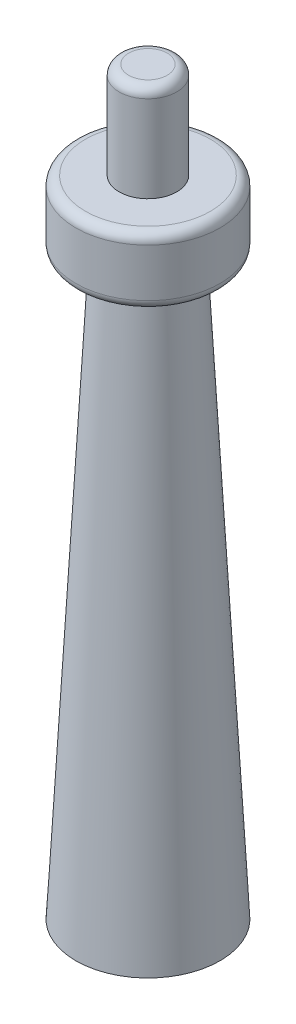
ISO-10303-21;
HEADER;
FILE_DESCRIPTION(('STEP AP214'),'2;1');
FILE_NAME('part.step','',(''),(''),'','','');
FILE_SCHEMA(('AUTOMOTIVE_DESIGN { 1 0 10303 214 1 1 1 1 }'));
ENDSEC;
DATA;
#1=APPLICATION_CONTEXT('core data for automotive mechanical design processes');
#2=APPLICATION_PROTOCOL_DEFINITION('international standard','automotive_design',2000,#1);
#3=PRODUCT_CONTEXT('',#1,'mechanical');
#4=PRODUCT('Part','Part','',(#3));
#5=PRODUCT_RELATED_PRODUCT_CATEGORY('part','',(#4));
#6=PRODUCT_DEFINITION_FORMATION('','',#4);
#7=PRODUCT_DEFINITION_CONTEXT('part definition',#1,'design');
#8=PRODUCT_DEFINITION('design','',#6,#7);
#9=PRODUCT_DEFINITION_SHAPE('','',#8);
#10=(LENGTH_UNIT() NAMED_UNIT(*) SI_UNIT(.MILLI.,.METRE.));
#11=(NAMED_UNIT(*) PLANE_ANGLE_UNIT() SI_UNIT($,.RADIAN.));
#12=(NAMED_UNIT(*) SI_UNIT($,.STERADIAN.) SOLID_ANGLE_UNIT());
#13=UNCERTAINTY_MEASURE_WITH_UNIT(LENGTH_MEASURE(1.E-05),#10,'distance_accuracy_value','');
#14=(GEOMETRIC_REPRESENTATION_CONTEXT(3) GLOBAL_UNCERTAINTY_ASSIGNED_CONTEXT((#13)) GLOBAL_UNIT_ASSIGNED_CONTEXT((#10,
#11,#12)) REPRESENTATION_CONTEXT('',''));
#15=CARTESIAN_POINT('',(0.,0.,0.));
#16=DIRECTION('',(0.,0.,1.));
#17=DIRECTION('',(1.,0.,0.));
#18=AXIS2_PLACEMENT_3D('',#15,#16,#17);
#19=CARTESIAN_POINT('',(0.,0.,0.));
#20=DIRECTION('',(0.,-1.,0.));
#21=DIRECTION('',(0.,0.,1.));
#22=AXIS2_PLACEMENT_3D('',#19,#20,#21);
#23=CONICAL_SURFACE('',#22,750.,0.0523598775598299);
#24=CARTESIAN_POINT('',(0.,5894.76640437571,0.));
#25=DIRECTION('',(0.,-1.,0.));
#26=DIRECTION('',(0.,0.,-1.));
#27=AXIS2_PLACEMENT_3D('',#24,#25,#26);
#28=CIRCLE('',#27,441.068383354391);
#29=CARTESIAN_POINT('',(0.,5894.76640437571,-441.068383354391));
#30=VERTEX_POINT('',#29);
#31=EDGE_CURVE('E58',#30,#30,#28,.T.);
#32=ORIENTED_EDGE('',*,*,#31,.T.);
#33=EDGE_LOOP('',(#32));
#34=FACE_BOUND('',#33,.T.);
#35=CARTESIAN_POINT('',(0.,0.,0.));
#36=DIRECTION('',(0.,1.,0.));
#37=DIRECTION('',(0.,0.,1.));
#38=AXIS2_PLACEMENT_3D('',#35,#36,#37);
#39=CIRCLE('',#38,750.);
#40=CARTESIAN_POINT('',(0.,0.,750.));
#41=VERTEX_POINT('',#40);
#42=EDGE_CURVE('E64',#41,#41,#39,.T.);
#43=ORIENTED_EDGE('',*,*,#42,.T.);
#44=EDGE_LOOP('',(#43));
#45=FACE_BOUND('',#44,.T.);
#46=ADVANCED_FACE('F32',(#34,#45),#23,.T.);
#47=CARTESIAN_POINT('',(0.,0.,0.));
#48=DIRECTION('',(0.,1.,0.));
#49=DIRECTION('',(0.,0.,1.));
#50=AXIS2_PLACEMENT_3D('',#47,#48,#49);
#51=PLANE('',#50);
#52=ORIENTED_EDGE('',*,*,#42,.F.);
#53=EDGE_LOOP('',(#52));
#54=FACE_BOUND('',#53,.T.);
#55=ADVANCED_FACE('F96',(#54),#51,.F.);
#56=CARTESIAN_POINT('',(0.,6700.,0.));
#57=DIRECTION('',(0.,-1.,0.));
#58=DIRECTION('',(0.,0.,-1.));
#59=AXIS2_PLACEMENT_3D('',#56,#57,#58);
#60=CYLINDRICAL_SURFACE('',#59,750.);
#61=CARTESIAN_POINT('',(0.,6600.,0.));
#62=DIRECTION('',(0.,1.,0.));
#63=DIRECTION('',(0.,0.,1.));
#64=AXIS2_PLACEMENT_3D('',#61,#62,#63);
#65=CIRCLE('',#64,750.);
#66=CARTESIAN_POINT('',(0.,6600.,750.));
#67=VERTEX_POINT('',#66);
#68=EDGE_CURVE('E43',#67,#67,#65,.F.);
#69=ORIENTED_EDGE('',*,*,#68,.T.);
#70=EDGE_LOOP('',(#69));
#71=FACE_BOUND('',#70,.T.);
#72=CARTESIAN_POINT('',(0.,6100.,0.));
#73=DIRECTION('',(0.,1.,0.));
#74=DIRECTION('',(0.,0.,1.));
#75=AXIS2_PLACEMENT_3D('',#72,#73,#74);
#76=CIRCLE('',#75,750.);
#77=CARTESIAN_POINT('',(0.,6100.,750.));
#78=VERTEX_POINT('',#77);
#79=EDGE_CURVE('E55',#78,#78,#76,.T.);
#80=ORIENTED_EDGE('',*,*,#79,.T.);
#81=EDGE_LOOP('',(#80));
#82=FACE_BOUND('',#81,.T.);
#83=ADVANCED_FACE('F77',(#71,#82),#60,.T.);
#84=CARTESIAN_POINT('',(0.,6700.,0.));
#85=DIRECTION('',(0.,1.,0.));
#86=DIRECTION('',(0.,0.,1.));
#87=AXIS2_PLACEMENT_3D('',#84,#85,#86);
#88=PLANE('',#87);
#89=CARTESIAN_POINT('',(0.,6700.,0.));
#90=DIRECTION('',(0.,1.,0.));
#91=DIRECTION('',(0.,0.,1.));
#92=AXIS2_PLACEMENT_3D('',#89,#90,#91);
#93=CIRCLE('',#92,300.);
#94=CARTESIAN_POINT('',(0.,6700.,300.));
#95=VERTEX_POINT('',#94);
#96=EDGE_CURVE('E67',#95,#95,#93,.T.);
#97=ORIENTED_EDGE('',*,*,#96,.F.);
#98=EDGE_LOOP('',(#97));
#99=FACE_BOUND('',#98,.T.);
#100=CARTESIAN_POINT('',(0.,6700.,0.));
#101=DIRECTION('',(0.,1.,0.));
#102=DIRECTION('',(0.,0.,1.));
#103=AXIS2_PLACEMENT_3D('',#100,#101,#102);
#104=CIRCLE('',#103,650.);
#105=CARTESIAN_POINT('',(0.,6700.,650.));
#106=VERTEX_POINT('',#105);
#107=EDGE_CURVE('E47',#106,#106,#104,.T.);
#108=ORIENTED_EDGE('',*,*,#107,.T.);
#109=EDGE_LOOP('',(#108));
#110=FACE_BOUND('',#109,.T.);
#111=ADVANCED_FACE('F73',(#99,#110),#88,.T.);
#112=CARTESIAN_POINT('',(0.,6000.,0.));
#113=DIRECTION('',(0.,1.,0.));
#114=DIRECTION('',(0.,0.,1.));
#115=AXIS2_PLACEMENT_3D('',#112,#113,#114);
#116=PLANE('',#115);
#117=CARTESIAN_POINT('',(0.,6000.,0.));
#118=DIRECTION('',(0.,1.,0.));
#119=DIRECTION('',(0.,0.,1.));
#120=AXIS2_PLACEMENT_3D('',#117,#118,#119);
#121=CIRCLE('',#120,650.);
#122=CARTESIAN_POINT('',(0.,6000.,650.));
#123=VERTEX_POINT('',#122);
#124=EDGE_CURVE('E52',#123,#123,#121,.F.);
#125=ORIENTED_EDGE('',*,*,#124,.T.);
#126=EDGE_LOOP('',(#125));
#127=FACE_BOUND('',#126,.T.);
#128=CARTESIAN_POINT('',(0.,6000.,0.));
#129=DIRECTION('',(0.,1.,0.));
#130=DIRECTION('',(0.,0.,1.));
#131=AXIS2_PLACEMENT_3D('',#128,#129,#130);
#132=CIRCLE('',#131,540.931336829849);
#133=CARTESIAN_POINT('',(0.,6000.,540.931336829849));
#134=VERTEX_POINT('',#133);
#135=EDGE_CURVE('E61',#134,#134,#132,.T.);
#136=ORIENTED_EDGE('',*,*,#135,.T.);
#137=EDGE_LOOP('',(#136));
#138=FACE_BOUND('',#137,.T.);
#139=ADVANCED_FACE('F76',(#127,#138),#116,.F.);
#140=CARTESIAN_POINT('',(0.,5900.,0.));
#141=DIRECTION('',(0.,1.,0.));
#142=DIRECTION('',(0.,0.,1.));
#143=AXIS2_PLACEMENT_3D('',#140,#141,#142);
#144=TOROIDAL_SURFACE('',#143,540.931336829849,100.);
#145=ORIENTED_EDGE('',*,*,#31,.F.);
#146=EDGE_LOOP('',(#145));
#147=FACE_BOUND('',#146,.T.);
#148=ORIENTED_EDGE('',*,*,#135,.F.);
#149=EDGE_LOOP('',(#148));
#150=FACE_BOUND('',#149,.T.);
#151=ADVANCED_FACE('F91',(#147,#150),#144,.F.);
#152=CARTESIAN_POINT('',(0.,6100.,0.));
#153=DIRECTION('',(0.,1.,0.));
#154=DIRECTION('',(0.,0.,1.));
#155=AXIS2_PLACEMENT_3D('',#152,#153,#154);
#156=TOROIDAL_SURFACE('',#155,650.,100.);
#157=ORIENTED_EDGE('',*,*,#124,.F.);
#158=EDGE_LOOP('',(#157));
#159=FACE_BOUND('',#158,.T.);
#160=ORIENTED_EDGE('',*,*,#79,.F.);
#161=EDGE_LOOP('',(#160));
#162=FACE_BOUND('',#161,.T.);
#163=ADVANCED_FACE('F83',(#159,#162),#156,.T.);
#164=CARTESIAN_POINT('',(0.,6600.,0.));
#165=DIRECTION('',(0.,1.,0.));
#166=DIRECTION('',(0.,0.,1.));
#167=AXIS2_PLACEMENT_3D('',#164,#165,#166);
#168=TOROIDAL_SURFACE('',#167,650.,100.);
#169=ORIENTED_EDGE('',*,*,#68,.F.);
#170=EDGE_LOOP('',(#169));
#171=FACE_BOUND('',#170,.T.);
#172=ORIENTED_EDGE('',*,*,#107,.F.);
#173=EDGE_LOOP('',(#172));
#174=FACE_BOUND('',#173,.T.);
#175=ADVANCED_FACE('F81',(#171,#174),#168,.T.);
#176=CARTESIAN_POINT('',(0.,7700.,0.));
#177=DIRECTION('',(0.,-1.,0.));
#178=DIRECTION('',(0.,0.,-1.));
#179=AXIS2_PLACEMENT_3D('',#176,#177,#178);
#180=CYLINDRICAL_SURFACE('',#179,300.);
#181=CARTESIAN_POINT('',(0.,7600.,0.));
#182=DIRECTION('',(0.,1.,0.));
#183=DIRECTION('',(0.,0.,1.));
#184=AXIS2_PLACEMENT_3D('',#181,#182,#183);
#185=CIRCLE('',#184,300.);
#186=CARTESIAN_POINT('',(0.,7600.,300.));
#187=VERTEX_POINT('',#186);
#188=EDGE_CURVE('E10',#187,#187,#185,.F.);
#189=ORIENTED_EDGE('',*,*,#188,.T.);
#190=EDGE_LOOP('',(#189));
#191=FACE_BOUND('',#190,.T.);
#192=ORIENTED_EDGE('',*,*,#96,.T.);
#193=EDGE_LOOP('',(#192));
#194=FACE_BOUND('',#193,.T.);
#195=ADVANCED_FACE('F71',(#191,#194),#180,.T.);
#196=CARTESIAN_POINT('',(0.,7700.,0.));
#197=DIRECTION('',(0.,1.,0.));
#198=DIRECTION('',(0.,0.,1.));
#199=AXIS2_PLACEMENT_3D('',#196,#197,#198);
#200=PLANE('',#199);
#201=CARTESIAN_POINT('',(0.,7700.,0.));
#202=DIRECTION('',(0.,1.,0.));
#203=DIRECTION('',(0.,0.,1.));
#204=AXIS2_PLACEMENT_3D('',#201,#202,#203);
#205=CIRCLE('',#204,200.);
#206=CARTESIAN_POINT('',(0.,7700.,200.));
#207=VERTEX_POINT('',#206);
#208=EDGE_CURVE('E39',#207,#207,#205,.T.);
#209=ORIENTED_EDGE('',*,*,#208,.T.);
#210=EDGE_LOOP('',(#209));
#211=FACE_BOUND('',#210,.T.);
#212=ADVANCED_FACE('F89',(#211),#200,.T.);
#213=CARTESIAN_POINT('',(0.,7600.,0.));
#214=DIRECTION('',(0.,1.,0.));
#215=DIRECTION('',(0.,0.,1.));
#216=AXIS2_PLACEMENT_3D('',#213,#214,#215);
#217=TOROIDAL_SURFACE('',#216,200.,100.);
#218=ORIENTED_EDGE('',*,*,#188,.F.);
#219=EDGE_LOOP('',(#218));
#220=FACE_BOUND('',#219,.T.);
#221=ORIENTED_EDGE('',*,*,#208,.F.);
#222=EDGE_LOOP('',(#221));
#223=FACE_BOUND('',#222,.T.);
#224=ADVANCED_FACE('F34',(#220,#223),#217,.T.);
#225=CLOSED_SHELL('',(#46,#55,#83,#111,#139,#151,#163,#175,#195,#212,#224));
#226=MANIFOLD_SOLID_BREP('B2',#225);
#227=ADVANCED_BREP_SHAPE_REPRESENTATION('',(#18,#226),#14);
#228=SHAPE_DEFINITION_REPRESENTATION(#9,#227);
ENDSEC;
END-ISO-10303-21;
